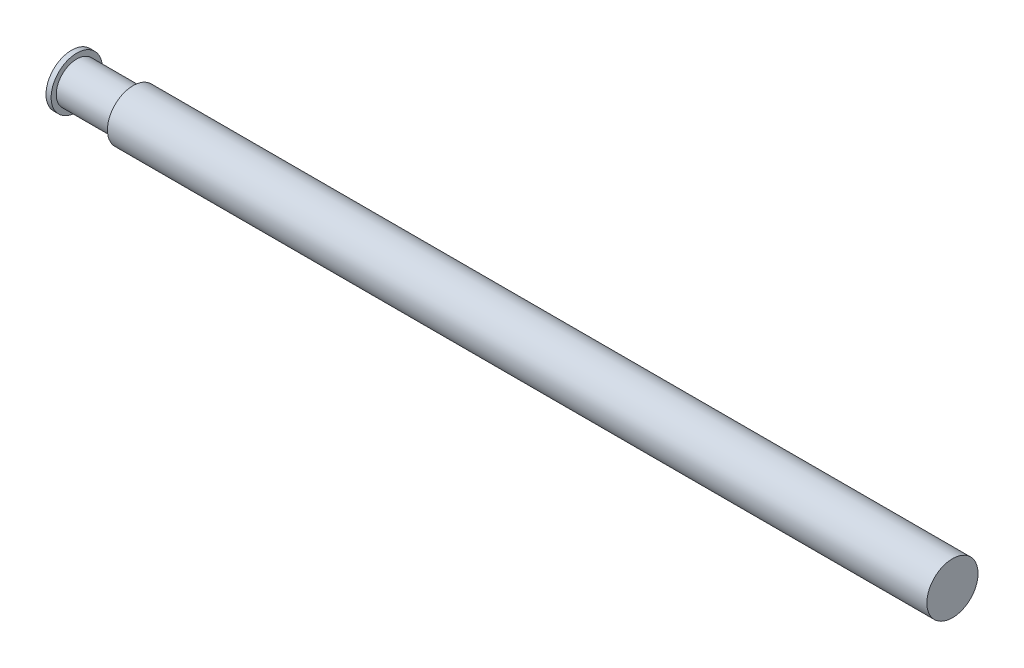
ISO-10303-21;
HEADER;
FILE_DESCRIPTION(('STEP AP214'),'2;1');
FILE_NAME('part.step','',(''),(''),'','','');
FILE_SCHEMA(('AUTOMOTIVE_DESIGN { 1 0 10303 214 1 1 1 1 }'));
ENDSEC;
DATA;
#1=APPLICATION_CONTEXT('core data for automotive mechanical design processes');
#2=APPLICATION_PROTOCOL_DEFINITION('international standard','automotive_design',2000,#1);
#3=PRODUCT_CONTEXT('',#1,'mechanical');
#4=PRODUCT('Part','Part','',(#3));
#5=PRODUCT_RELATED_PRODUCT_CATEGORY('part','',(#4));
#6=PRODUCT_DEFINITION_FORMATION('','',#4);
#7=PRODUCT_DEFINITION_CONTEXT('part definition',#1,'design');
#8=PRODUCT_DEFINITION('design','',#6,#7);
#9=PRODUCT_DEFINITION_SHAPE('','',#8);
#10=(LENGTH_UNIT() NAMED_UNIT(*) SI_UNIT(.MILLI.,.METRE.));
#11=(NAMED_UNIT(*) PLANE_ANGLE_UNIT() SI_UNIT($,.RADIAN.));
#12=(NAMED_UNIT(*) SI_UNIT($,.STERADIAN.) SOLID_ANGLE_UNIT());
#13=UNCERTAINTY_MEASURE_WITH_UNIT(LENGTH_MEASURE(1.E-05),#10,'distance_accuracy_value','');
#14=(GEOMETRIC_REPRESENTATION_CONTEXT(3) GLOBAL_UNCERTAINTY_ASSIGNED_CONTEXT((#13)) GLOBAL_UNIT_ASSIGNED_CONTEXT((#10,
#11,#12)) REPRESENTATION_CONTEXT('',''));
#15=CARTESIAN_POINT('',(0.,0.,0.));
#16=DIRECTION('',(0.,0.,1.));
#17=DIRECTION('',(1.,0.,0.));
#18=AXIS2_PLACEMENT_3D('',#15,#16,#17);
#19=CARTESIAN_POINT('',(60.0000000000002,5.00000000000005,0.));
#20=DIRECTION('',(-1.,0.,0.));
#21=DIRECTION('',(0.,0.,1.));
#22=AXIS2_PLACEMENT_3D('',#19,#20,#21);
#23=PLANE('',#22);
#24=CARTESIAN_POINT('',(60.0000000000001,0.,0.));
#25=DIRECTION('',(-1.,0.,0.));
#26=DIRECTION('',(0.,0.,1.));
#27=AXIS2_PLACEMENT_3D('',#24,#25,#26);
#28=CIRCLE('',#27,5.00000000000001);
#29=CARTESIAN_POINT('',(60.0000000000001,0.,4.99999999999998));
#30=VERTEX_POINT('',#29);
#31=EDGE_CURVE('E10',#30,#30,#28,.T.);
#32=ORIENTED_EDGE('',*,*,#31,.F.);
#33=EDGE_LOOP('',(#32));
#34=FACE_BOUND('',#33,.T.);
#35=ADVANCED_FACE('F27',(#34),#23,.F.);
#36=CARTESIAN_POINT('',(-87.0000000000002,0.,0.));
#37=DIRECTION('',(-1.,0.,0.));
#38=DIRECTION('',(0.,0.,1.));
#39=AXIS2_PLACEMENT_3D('',#36,#37,#38);
#40=CYLINDRICAL_SURFACE('',#39,5.);
#41=CARTESIAN_POINT('',(-100.,0.,0.));
#42=DIRECTION('',(-1.,0.,0.));
#43=DIRECTION('',(0.,0.,1.));
#44=AXIS2_PLACEMENT_3D('',#41,#42,#43);
#45=CIRCLE('',#44,5.);
#46=CARTESIAN_POINT('',(-100.,0.,5.00000000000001));
#47=VERTEX_POINT('',#46);
#48=EDGE_CURVE('E33',#47,#47,#45,.T.);
#49=ORIENTED_EDGE('',*,*,#48,.F.);
#50=EDGE_LOOP('',(#49));
#51=FACE_BOUND('',#50,.T.);
#52=ORIENTED_EDGE('',*,*,#31,.T.);
#53=EDGE_LOOP('',(#52));
#54=FACE_BOUND('',#53,.T.);
#55=ADVANCED_FACE('F87',(#51,#54),#40,.T.);
#56=CARTESIAN_POINT('',(-100.,4.00000000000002,0.));
#57=DIRECTION('',(1.,0.,0.));
#58=DIRECTION('',(0.,0.,-1.));
#59=AXIS2_PLACEMENT_3D('',#56,#57,#58);
#60=PLANE('',#59);
#61=CARTESIAN_POINT('',(-100.,0.,0.));
#62=DIRECTION('',(-1.,0.,0.));
#63=DIRECTION('',(0.,0.,1.));
#64=AXIS2_PLACEMENT_3D('',#61,#62,#63);
#65=CIRCLE('',#64,4.);
#66=CARTESIAN_POINT('',(-100.,0.,4.00000000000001));
#67=VERTEX_POINT('',#66);
#68=EDGE_CURVE('E37',#67,#67,#65,.T.);
#69=ORIENTED_EDGE('',*,*,#68,.F.);
#70=EDGE_LOOP('',(#69));
#71=FACE_BOUND('',#70,.T.);
#72=ORIENTED_EDGE('',*,*,#48,.T.);
#73=EDGE_LOOP('',(#72));
#74=FACE_BOUND('',#73,.T.);
#75=ADVANCED_FACE('F82',(#71,#74),#60,.F.);
#76=CARTESIAN_POINT('',(-87.0000000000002,0.,0.));
#77=DIRECTION('',(-1.,0.,0.));
#78=DIRECTION('',(0.,0.,1.));
#79=AXIS2_PLACEMENT_3D('',#76,#77,#78);
#80=CYLINDRICAL_SURFACE('',#79,4.);
#81=CARTESIAN_POINT('',(-111.,0.,0.));
#82=DIRECTION('',(-1.,0.,0.));
#83=DIRECTION('',(0.,0.,1.));
#84=AXIS2_PLACEMENT_3D('',#81,#82,#83);
#85=CIRCLE('',#84,4.);
#86=CARTESIAN_POINT('',(-111.,0.,4.00000000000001));
#87=VERTEX_POINT('',#86);
#88=EDGE_CURVE('E41',#87,#87,#85,.T.);
#89=ORIENTED_EDGE('',*,*,#88,.F.);
#90=EDGE_LOOP('',(#89));
#91=FACE_BOUND('',#90,.T.);
#92=ORIENTED_EDGE('',*,*,#68,.T.);
#93=EDGE_LOOP('',(#92));
#94=FACE_BOUND('',#93,.T.);
#95=ADVANCED_FACE('F76',(#91,#94),#80,.T.);
#96=CARTESIAN_POINT('',(-111.,5.00000000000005,0.));
#97=DIRECTION('',(-1.,0.,0.));
#98=DIRECTION('',(0.,0.,1.));
#99=AXIS2_PLACEMENT_3D('',#96,#97,#98);
#100=PLANE('',#99);
#101=CARTESIAN_POINT('',(-111.,0.,0.));
#102=DIRECTION('',(-1.,0.,0.));
#103=DIRECTION('',(0.,0.,1.));
#104=AXIS2_PLACEMENT_3D('',#101,#102,#103);
#105=CIRCLE('',#104,5.);
#106=CARTESIAN_POINT('',(-111.,0.,5.00000000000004));
#107=VERTEX_POINT('',#106);
#108=EDGE_CURVE('E46',#107,#107,#105,.T.);
#109=ORIENTED_EDGE('',*,*,#108,.F.);
#110=EDGE_LOOP('',(#109));
#111=FACE_BOUND('',#110,.T.);
#112=ORIENTED_EDGE('',*,*,#88,.T.);
#113=EDGE_LOOP('',(#112));
#114=FACE_BOUND('',#113,.T.);
#115=ADVANCED_FACE('F70',(#111,#114),#100,.F.);
#116=CARTESIAN_POINT('',(-87.0000000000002,0.,0.));
#117=DIRECTION('',(-1.,0.,0.));
#118=DIRECTION('',(0.,0.,1.));
#119=AXIS2_PLACEMENT_3D('',#116,#117,#118);
#120=CYLINDRICAL_SURFACE('',#119,4.99999999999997);
#121=CARTESIAN_POINT('',(-112.,0.,0.));
#122=DIRECTION('',(-1.,0.,0.));
#123=DIRECTION('',(0.,0.,1.));
#124=AXIS2_PLACEMENT_3D('',#121,#122,#123);
#125=CIRCLE('',#124,4.99999999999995);
#126=CARTESIAN_POINT('',(-112.,0.,4.99999999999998));
#127=VERTEX_POINT('',#126);
#128=EDGE_CURVE('E49',#127,#127,#125,.T.);
#129=ORIENTED_EDGE('',*,*,#128,.F.);
#130=EDGE_LOOP('',(#129));
#131=FACE_BOUND('',#130,.T.);
#132=ORIENTED_EDGE('',*,*,#108,.T.);
#133=EDGE_LOOP('',(#132));
#134=FACE_BOUND('',#133,.T.);
#135=ADVANCED_FACE('F64',(#131,#134),#120,.T.);
#136=CARTESIAN_POINT('',(-112.,0.,0.));
#137=DIRECTION('',(1.,0.,0.));
#138=DIRECTION('',(0.,0.,-1.));
#139=AXIS2_PLACEMENT_3D('',#136,#137,#138);
#140=PLANE('',#139);
#141=CARTESIAN_POINT('',(-111.999999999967,-0.301764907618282,-0.22130706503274));
#142=DIRECTION('',(-1.,0.,0.));
#143=DIRECTION('',(0.,0.,1.));
#144=AXIS2_PLACEMENT_3D('',#141,#142,#143);
#145=CIRCLE('',#144,3.);
#146=CARTESIAN_POINT('',(-111.999999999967,-0.301764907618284,2.77869293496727));
#147=VERTEX_POINT('',#146);
#148=EDGE_CURVE('E55',#147,#147,#145,.T.);
#149=ORIENTED_EDGE('',*,*,#148,.F.);
#150=EDGE_LOOP('',(#149));
#151=FACE_BOUND('',#150,.T.);
#152=ORIENTED_EDGE('',*,*,#128,.T.);
#153=EDGE_LOOP('',(#152));
#154=FACE_BOUND('',#153,.T.);
#155=ADVANCED_FACE('F61',(#151,#154),#140,.F.);
#156=CARTESIAN_POINT('',(-107.999999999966,-0.30176490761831,-0.221307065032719));
#157=DIRECTION('',(-1.,0.,0.));
#158=DIRECTION('',(0.,0.,1.));
#159=AXIS2_PLACEMENT_3D('',#156,#157,#158);
#160=CYLINDRICAL_SURFACE('',#159,3.);
#161=CARTESIAN_POINT('',(-107.999999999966,-0.30176490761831,-0.221307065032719));
#162=DIRECTION('',(-1.,0.,0.));
#163=DIRECTION('',(0.,0.,1.));
#164=AXIS2_PLACEMENT_3D('',#161,#162,#163);
#165=CIRCLE('',#164,3.);
#166=CARTESIAN_POINT('',(-107.999999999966,-0.301764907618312,2.77869293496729));
#167=VERTEX_POINT('',#166);
#168=EDGE_CURVE('E52',#167,#167,#165,.T.);
#169=ORIENTED_EDGE('',*,*,#168,.F.);
#170=EDGE_LOOP('',(#169));
#171=FACE_BOUND('',#170,.T.);
#172=ORIENTED_EDGE('',*,*,#148,.T.);
#173=EDGE_LOOP('',(#172));
#174=FACE_BOUND('',#173,.T.);
#175=ADVANCED_FACE('F59',(#171,#174),#160,.F.);
#176=CARTESIAN_POINT('',(-107.999999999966,-0.30176490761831,-0.221307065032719));
#177=DIRECTION('',(-1.,0.,0.));
#178=DIRECTION('',(0.,0.,1.));
#179=AXIS2_PLACEMENT_3D('',#176,#177,#178);
#180=PLANE('',#179);
#181=ORIENTED_EDGE('',*,*,#168,.T.);
#182=EDGE_LOOP('',(#181));
#183=FACE_BOUND('',#182,.T.);
#184=ADVANCED_FACE('F139',(#183),#180,.T.);
#185=CLOSED_SHELL('',(#35,#55,#75,#95,#115,#135,#155,#175,#184));
#186=MANIFOLD_SOLID_BREP('B2',#185);
#187=ADVANCED_BREP_SHAPE_REPRESENTATION('',(#18,#186),#14);
#188=SHAPE_DEFINITION_REPRESENTATION(#9,#187);
ENDSEC;
END-ISO-10303-21;
